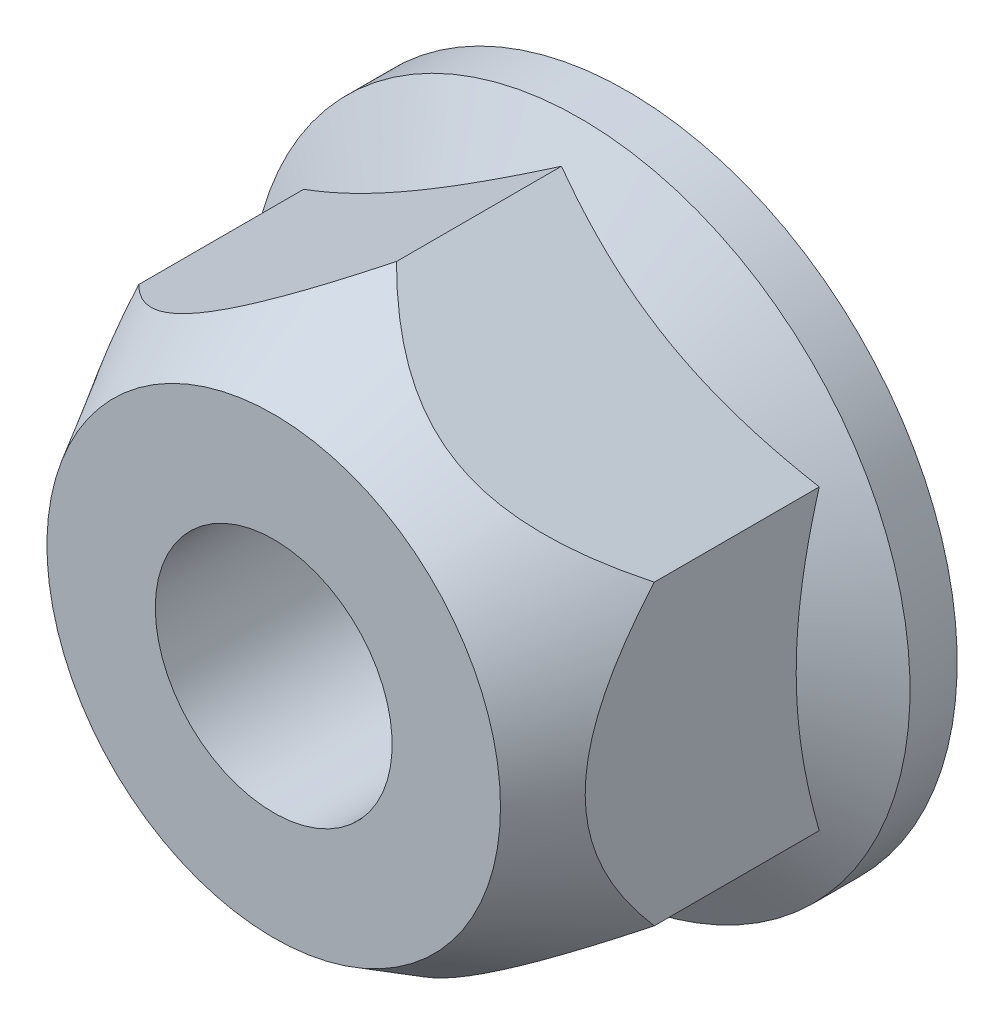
from build123d import *

# Parameters (mm, degrees)
HEX_START   = 7.62
HEXSKE_R    = 2.5527
HEX_2_DEPTH = 7.62


with BuildPart() as part:
    # BaseNutSke → BaseNut (revolve)
    with BuildSketch(Plane(origin=(0, 0, 0), x_dir=(0, 0, -1), z_dir=(1, 0, 0)), mode=Mode.PRIVATE) as basenut_sk:
        Polygon((-7.62, 2.5527), (-7.62, 5.55625), (-1.914212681, 5.55625), (-1.016, 7.112), (0, 7.112), (0, 2.5527), align=None)
    revolve(basenut_sk.sketch.rotate(Axis((0, 0, 0), (0, 0, 1)), 90), axis=Axis((0, 0, 0), (0, 0, 1)))

    # HexSke → Hex 2 (add)
    with BuildSketch(Plane.XY.offset(HEX_START)):
        Polygon((5.55625, -3.207902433), (5.55625, 3.207902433), (0, 6.415804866), (-5.55625, 3.207902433), (-5.55625, -3.207902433), (0, -6.415804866), align=None)
        with Locations(Location((0, 0, 0), (0, 0, 180))):
            Circle(HEXSKE_R, mode=Mode.SUBTRACT)
    extrude(amount=-HEX_2_DEPTH)

    # FilletSke → HexFillet (revolve, cut)
    with BuildSketch(Plane(origin=(0, 0, 0), x_dir=(0, 0, -1), z_dir=(1, 0, 0)), mode=Mode.PRIVATE) as hexfillet_sk:
        Polygon((-7.62, 4.88810629), (-4.973948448, 6.415804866), (-7.62, 6.415804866), align=None)
    revolve(hexfillet_sk.sketch.rotate(Axis((0, 0, 0), (0, 0, -1)), 300.000000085), axis=Axis((0, 0, 0), (0, 0, -1)), mode=Mode.SUBTRACT)

    # ThdSchSke → ThreadSchematic (revolve, cut)
    with BuildSketch(Plane(origin=(0, 0, 0), x_dir=(0, 0, -1), z_dir=(1, 0, 0)), mode=Mode.PRIVATE) as threadschematic_sk:
        Polygon((-0.359285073, 2.5527), (0, 3.175), (0.359285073, 2.5527), align=None)
    revolve(threadschematic_sk.sketch.rotate(Axis((0, 0, 0), (0, 0, 1)), 90), axis=Axis((0, 0, 0), (0, 0, 1)), mode=Mode.SUBTRACT)


solid = part.part
